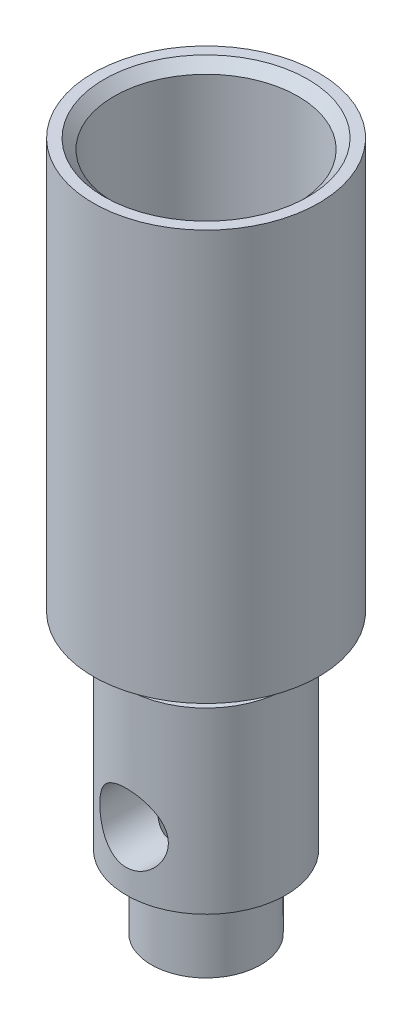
ISO-10303-21;
HEADER;
FILE_DESCRIPTION(('STEP AP214'),'2;1');
FILE_NAME('part.step','',(''),(''),'','','');
FILE_SCHEMA(('AUTOMOTIVE_DESIGN { 1 0 10303 214 1 1 1 1 }'));
ENDSEC;
DATA;
#1=APPLICATION_CONTEXT('core data for automotive mechanical design processes');
#2=APPLICATION_PROTOCOL_DEFINITION('international standard','automotive_design',2000,#1);
#3=PRODUCT_CONTEXT('',#1,'mechanical');
#4=PRODUCT('Part','Part','',(#3));
#5=PRODUCT_RELATED_PRODUCT_CATEGORY('part','',(#4));
#6=PRODUCT_DEFINITION_FORMATION('','',#4);
#7=PRODUCT_DEFINITION_CONTEXT('part definition',#1,'design');
#8=PRODUCT_DEFINITION('design','',#6,#7);
#9=PRODUCT_DEFINITION_SHAPE('','',#8);
#10=(LENGTH_UNIT() NAMED_UNIT(*) SI_UNIT(.MILLI.,.METRE.));
#11=(NAMED_UNIT(*) PLANE_ANGLE_UNIT() SI_UNIT($,.RADIAN.));
#12=(NAMED_UNIT(*) SI_UNIT($,.STERADIAN.) SOLID_ANGLE_UNIT());
#13=UNCERTAINTY_MEASURE_WITH_UNIT(LENGTH_MEASURE(1.E-05),#10,'distance_accuracy_value','');
#14=(GEOMETRIC_REPRESENTATION_CONTEXT(3) GLOBAL_UNCERTAINTY_ASSIGNED_CONTEXT((#13)) GLOBAL_UNIT_ASSIGNED_CONTEXT((#10,
#11,#12)) REPRESENTATION_CONTEXT('',''));
#15=CARTESIAN_POINT('',(0.,0.,0.));
#16=DIRECTION('',(0.,0.,1.));
#17=DIRECTION('',(1.,0.,0.));
#18=AXIS2_PLACEMENT_3D('',#15,#16,#17);
#19=CARTESIAN_POINT('',(0.,0.,0.));
#20=DIRECTION('',(0.,-1.,0.));
#21=DIRECTION('',(0.,0.,-1.));
#22=AXIS2_PLACEMENT_3D('',#19,#20,#21);
#23=CYLINDRICAL_SURFACE('',#22,5.55625);
#24=CARTESIAN_POINT('',(0.,5.08,0.));
#25=DIRECTION('',(0.,-1.,0.));
#26=DIRECTION('',(0.,0.,-1.));
#27=AXIS2_PLACEMENT_3D('',#24,#25,#26);
#28=CIRCLE('',#27,5.55625);
#29=CARTESIAN_POINT('',(0.,5.08,-5.55625));
#30=VERTEX_POINT('',#29);
#31=EDGE_CURVE('E124',#30,#30,#28,.T.);
#32=ORIENTED_EDGE('',*,*,#31,.F.);
#33=EDGE_LOOP('',(#32));
#34=FACE_BOUND('',#33,.T.);
#35=CARTESIAN_POINT('',(0.,17.526,0.));
#36=DIRECTION('',(0.,-1.,0.));
#37=DIRECTION('',(0.,0.,-1.));
#38=AXIS2_PLACEMENT_3D('',#35,#36,#37);
#39=CIRCLE('',#38,5.55625);
#40=CARTESIAN_POINT('',(0.,17.526,-5.55625));
#41=VERTEX_POINT('',#40);
#42=EDGE_CURVE('E129',#41,#41,#39,.T.);
#43=ORIENTED_EDGE('',*,*,#42,.T.);
#44=EDGE_LOOP('',(#43));
#45=FACE_BOUND('',#44,.T.);
#46=CARTESIAN_POINT('',(-2.3876,9.144,5.0170987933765));
#47=CARTESIAN_POINT('',(-2.38759394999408,9.27091680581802,5.01710512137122));
#48=CARTESIAN_POINT('',(-2.37741593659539,9.39805321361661,5.02198423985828));
#49=CARTESIAN_POINT('',(-2.33713133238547,9.64861629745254,5.04085334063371));
#50=CARTESIAN_POINT('',(-2.30697224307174,9.77203230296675,5.05486732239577));
#51=CARTESIAN_POINT('',(-2.22813032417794,10.0110864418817,5.0901068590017));
#52=CARTESIAN_POINT('',(-2.17952627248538,10.1267552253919,5.11130170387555));
#53=CARTESIAN_POINT('',(-2.0654092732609,10.3482649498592,5.1584684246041));
#54=CARTESIAN_POINT('',(-1.9998995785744,10.4541077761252,5.18443938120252));
#55=CARTESIAN_POINT('',(-1.84918996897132,10.6600379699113,5.24015587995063));
#56=CARTESIAN_POINT('',(-1.76304291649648,10.7593965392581,5.27003448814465));
#57=CARTESIAN_POINT('',(-1.57549029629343,10.9427989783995,5.32910945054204));
#58=CARTESIAN_POINT('',(-1.47407865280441,11.0268367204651,5.35830552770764));
#59=CARTESIAN_POINT('',(-1.25307017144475,11.1810141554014,5.41436083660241));
#60=CARTESIAN_POINT('',(-1.13284568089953,11.2503226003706,5.44104751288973));
#61=CARTESIAN_POINT('',(-0.881088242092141,11.3674124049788,5.4874348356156));
#62=CARTESIAN_POINT('',(-0.749560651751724,11.4152038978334,5.50713876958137));
#63=CARTESIAN_POINT('',(-0.486593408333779,11.4852268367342,5.53639486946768));
#64=CARTESIAN_POINT('',(-0.355545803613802,11.5087181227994,5.54644523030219));
#65=CARTESIAN_POINT('',(-0.0910097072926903,11.5335560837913,5.55707873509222));
#66=CARTESIAN_POINT('',(0.0424777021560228,11.5349123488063,5.55766597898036));
#67=CARTESIAN_POINT('',(0.298899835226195,11.5160770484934,5.54959232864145));
#68=CARTESIAN_POINT('',(0.421958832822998,11.4972729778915,5.54152691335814));
#69=CARTESIAN_POINT('',(0.66297641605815,11.4410442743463,5.51788409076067));
#70=CARTESIAN_POINT('',(0.78093462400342,11.4036182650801,5.50230612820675));
#71=CARTESIAN_POINT('',(1.01058344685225,11.3107800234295,5.46483218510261));
#72=CARTESIAN_POINT('',(1.12215052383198,11.2551013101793,5.44284316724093));
#73=CARTESIAN_POINT('',(1.33465144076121,11.1276098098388,5.3946740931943));
#74=CARTESIAN_POINT('',(1.43558143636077,11.0557912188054,5.36849253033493));
#75=CARTESIAN_POINT('',(1.63191608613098,10.8918641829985,5.31224569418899));
#76=CARTESIAN_POINT('',(1.72635316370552,10.7986447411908,5.2820363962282));
#77=CARTESIAN_POINT('',(1.89868884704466,10.5976675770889,5.22256862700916));
#78=CARTESIAN_POINT('',(1.97658023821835,10.4899035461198,5.19331057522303));
#79=CARTESIAN_POINT('',(2.11632512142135,10.2579102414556,5.13799091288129));
#80=CARTESIAN_POINT('',(2.17748241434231,10.1332207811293,5.11208668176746));
#81=CARTESIAN_POINT('',(2.27753022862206,9.87390616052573,5.06831206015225));
#82=CARTESIAN_POINT('',(2.31643784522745,9.73928871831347,5.05043550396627));
#83=CARTESIAN_POINT('',(2.36833576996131,9.47365512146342,5.02629786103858));
#84=CARTESIAN_POINT('',(2.38290256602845,9.34301229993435,5.01933224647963));
#85=CARTESIAN_POINT('',(2.39036026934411,9.08099121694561,5.01578699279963));
#86=CARTESIAN_POINT('',(2.38325950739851,8.94961325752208,5.01920336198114));
#87=CARTESIAN_POINT('',(2.34902455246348,8.69955717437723,5.03530557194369));
#88=CARTESIAN_POINT('',(2.32332737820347,8.58063378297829,5.04732586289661));
#89=CARTESIAN_POINT('',(2.25456591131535,8.34890087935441,5.07841111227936));
#90=CARTESIAN_POINT('',(2.21149738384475,8.23609286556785,5.09747778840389));
#91=CARTESIAN_POINT('',(2.10714498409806,8.01428819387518,5.14151576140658));
#92=CARTESIAN_POINT('',(2.04514908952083,7.90567187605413,5.16670816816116));
#93=CARTESIAN_POINT('',(1.90539516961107,7.69984138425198,5.21986279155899));
#94=CARTESIAN_POINT('',(1.82763002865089,7.60263238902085,5.24782625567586));
#95=CARTESIAN_POINT('',(1.65052261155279,7.41350173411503,5.30632785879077));
#96=CARTESIAN_POINT('',(1.54988667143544,7.32278992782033,5.33687687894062));
#97=CARTESIAN_POINT('',(1.33413545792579,7.15930001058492,5.39485516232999));
#98=CARTESIAN_POINT('',(1.21901869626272,7.08652374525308,5.42228410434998));
#99=CARTESIAN_POINT('',(0.976387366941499,6.96087162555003,5.4711932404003));
#100=CARTESIAN_POINT('',(0.848811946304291,6.90810029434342,5.49264203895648));
#101=CARTESIAN_POINT('',(0.585429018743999,6.82517820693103,5.52691372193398));
#102=CARTESIAN_POINT('',(0.449626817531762,6.79501303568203,5.5397421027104));
#103=CARTESIAN_POINT('',(0.184422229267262,6.76005768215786,5.55465910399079));
#104=CARTESIAN_POINT('',(0.0552833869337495,6.7535649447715,5.55746798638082));
#105=CARTESIAN_POINT('',(-0.202214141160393,6.76149608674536,5.55406060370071));
#106=CARTESIAN_POINT('',(-0.330572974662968,6.7759158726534,5.54784610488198));
#107=CARTESIAN_POINT('',(-0.577620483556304,6.82404143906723,5.52748069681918));
#108=CARTESIAN_POINT('',(-0.696490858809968,6.85696294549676,5.51365296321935));
#109=CARTESIAN_POINT('',(-0.926955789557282,6.94027364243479,5.4796212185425));
#110=CARTESIAN_POINT('',(-1.03854900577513,6.99066603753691,5.4594160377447));
#111=CARTESIAN_POINT('',(-1.25691717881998,7.11004353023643,5.41341784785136));
#112=CARTESIAN_POINT('',(-1.36323956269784,7.17977243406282,5.38741184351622));
#113=CARTESIAN_POINT('',(-1.56313607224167,7.33478607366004,5.33284850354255));
#114=CARTESIAN_POINT('',(-1.65670510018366,7.42007699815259,5.30429015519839));
#115=CARTESIAN_POINT('',(-1.83556612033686,7.61113619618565,5.24520000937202));
#116=CARTESIAN_POINT('',(-1.91975366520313,7.71794538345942,5.21467649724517));
#117=CARTESIAN_POINT('',(-2.0692070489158,7.94503509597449,5.15720128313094));
#118=CARTESIAN_POINT('',(-2.13446182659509,8.06532343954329,5.1302516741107));
#119=CARTESIAN_POINT('',(-2.24375276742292,8.31643097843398,5.08341040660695));
#120=CARTESIAN_POINT('',(-2.2878192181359,8.44723482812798,5.06350868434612));
#121=CARTESIAN_POINT('',(-2.33655637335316,8.64811814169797,5.04110266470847));
#122=CARTESIAN_POINT('',(-2.34990392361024,8.71579306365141,5.03487744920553));
#123=CARTESIAN_POINT('',(-2.3707053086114,8.85221836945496,5.02511781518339));
#124=CARTESIAN_POINT('',(-2.37816365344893,8.92096788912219,5.02158133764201));
#125=CARTESIAN_POINT('',(-2.38428168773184,9.0155639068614,5.01867683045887));
#126=CARTESIAN_POINT('',(-2.38552536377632,9.04123087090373,5.01808580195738));
#127=CARTESIAN_POINT('',(-2.38718513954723,9.09259555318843,5.01729613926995));
#128=CARTESIAN_POINT('',(-2.38760122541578,9.11829327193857,5.01709751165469));
#129=CARTESIAN_POINT('',(-2.3876,9.144,5.0170987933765));
#130=B_SPLINE_CURVE_WITH_KNOTS('',3,(#46,#47,#48,#49,#50,#51,#52,#53,#54,#55,#56,#57,#58,#59,
#60,#61,#62,#63,#64,#65,#66,#67,#68,#69,#70,#71,#72,#73,#74,#75,#76,#77,#78,#79,#80,#81,#82,#83,
#84,#85,#86,#87,#88,#89,#90,#91,#92,#93,#94,#95,#96,#97,#98,#99,#100,#101,#102,#103,#104,#105,
#106,#107,#108,#109,#110,#111,#112,#113,#114,#115,#116,#117,#118,#119,#120,#121,#122,#123,#124,
#125,#126,#127,#128,#129),.UNSPECIFIED.,.T.,.F.,(4,2,2,2,2,2,2,2,2,2,2,2,2,2,2,2,2,2,2,2,2,2,2,
2,2,2,2,2,2,2,2,2,2,2,2,2,2,2,2,2,2,4),(0.,0.380647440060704,0.762298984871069,1.1423385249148,
1.52230499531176,1.92511957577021,2.32809491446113,2.74986940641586,3.17144505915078,
3.56986297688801,3.9681082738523,4.34060522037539,4.71312970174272,5.09135497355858,
5.46971647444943,5.8761876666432,6.28283573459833,6.70445817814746,7.12575623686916,
7.51852811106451,7.91114899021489,8.27628855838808,8.64151719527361,9.02266234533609,
9.40397986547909,9.81871317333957,10.2334891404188,10.6504033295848,11.0670514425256,
11.4530669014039,11.83900681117,12.2097024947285,12.5804662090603,12.9681569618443,
13.3560022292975,13.7721883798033,14.1886171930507,14.6044489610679,14.8119752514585,
15.0193424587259,15.096440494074,15.1735398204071),.UNSPECIFIED.);
#131=CARTESIAN_POINT('',(-2.3876,9.144,5.0170987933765));
#132=VERTEX_POINT('',#131);
#133=EDGE_CURVE('E96',#132,#132,#130,.T.);
#134=ORIENTED_EDGE('',*,*,#133,.T.);
#135=EDGE_LOOP('',(#134));
#136=FACE_BOUND('',#135,.T.);
#137=ADVANCED_FACE('F28',(#34,#45,#136),#23,.T.);
#138=CARTESIAN_POINT('',(0.,0.,0.));
#139=DIRECTION('',(0.,-1.,0.));
#140=DIRECTION('',(0.,0.,-1.));
#141=AXIS2_PLACEMENT_3D('',#138,#139,#140);
#142=CYLINDRICAL_SURFACE('',#141,2.3876);
#143=CARTESIAN_POINT('',(0.,25.781,0.));
#144=DIRECTION('',(0.,-1.,0.));
#145=DIRECTION('',(0.,0.,-1.));
#146=AXIS2_PLACEMENT_3D('',#143,#144,#145);
#147=CIRCLE('',#146,2.3876);
#148=CARTESIAN_POINT('',(0.,25.781,-2.3876));
#149=VERTEX_POINT('',#148);
#150=EDGE_CURVE('E150',#149,#149,#147,.T.);
#151=ORIENTED_EDGE('',*,*,#150,.F.);
#152=EDGE_LOOP('',(#151));
#153=FACE_BOUND('',#152,.T.);
#154=CARTESIAN_POINT('',(0.,0.,0.));
#155=DIRECTION('',(0.,-1.,0.));
#156=DIRECTION('',(0.,0.,-1.));
#157=AXIS2_PLACEMENT_3D('',#154,#155,#156);
#158=CIRCLE('',#157,2.38760000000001);
#159=CARTESIAN_POINT('',(0.,0.,-2.38760000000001));
#160=VERTEX_POINT('',#159);
#161=EDGE_CURVE('E152',#160,#160,#158,.T.);
#162=ORIENTED_EDGE('',*,*,#161,.T.);
#163=EDGE_LOOP('',(#162));
#164=FACE_BOUND('',#163,.T.);
#165=CARTESIAN_POINT('',(0.,9.144,0.));
#166=DIRECTION('',(0.,-0.707106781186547,0.707106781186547));
#167=DIRECTION('',(0.,-0.707106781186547,-0.707106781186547));
#168=AXIS2_PLACEMENT_3D('',#165,#166,#167);
#169=ELLIPSE('',#168,3.376576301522,2.3876);
#170=CARTESIAN_POINT('',(2.3876,9.144,0.));
#171=VERTEX_POINT('',#170);
#172=CARTESIAN_POINT('',(-2.3876,9.144,0.));
#173=VERTEX_POINT('',#172);
#174=EDGE_CURVE('E36',#171,#173,#169,.T.);
#175=ORIENTED_EDGE('',*,*,#174,.T.);
#176=CARTESIAN_POINT('',(0.,9.144,0.));
#177=DIRECTION('',(0.,-0.707106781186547,-0.707106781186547));
#178=DIRECTION('',(0.,-0.707106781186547,0.707106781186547));
#179=AXIS2_PLACEMENT_3D('',#176,#177,#178);
#180=ELLIPSE('',#179,3.376576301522,2.3876);
#181=EDGE_CURVE('E11',#173,#171,#180,.F.);
#182=ORIENTED_EDGE('',*,*,#181,.T.);
#183=EDGE_LOOP('',(#175,#182));
#184=FACE_BOUND('',#183,.T.);
#185=ADVANCED_FACE('F45',(#153,#164,#184),#142,.F.);
#186=CARTESIAN_POINT('',(0.,0.,0.));
#187=DIRECTION('',(0.,-1.,0.));
#188=DIRECTION('',(0.,0.,-1.));
#189=AXIS2_PLACEMENT_3D('',#186,#187,#188);
#190=CYLINDRICAL_SURFACE('',#189,3.81);
#191=CARTESIAN_POINT('',(0.,5.08,0.));
#192=DIRECTION('',(0.,-1.,0.));
#193=DIRECTION('',(0.,0.,-1.));
#194=AXIS2_PLACEMENT_3D('',#191,#192,#193);
#195=CIRCLE('',#194,3.81);
#196=CARTESIAN_POINT('',(0.,5.08,-3.81));
#197=VERTEX_POINT('',#196);
#198=EDGE_CURVE('E120',#197,#197,#195,.T.);
#199=ORIENTED_EDGE('',*,*,#198,.T.);
#200=EDGE_LOOP('',(#199));
#201=FACE_BOUND('',#200,.T.);
#202=CARTESIAN_POINT('',(0.,0.,0.));
#203=DIRECTION('',(0.,-1.,0.));
#204=DIRECTION('',(0.,0.,-1.));
#205=AXIS2_PLACEMENT_3D('',#202,#203,#204);
#206=CIRCLE('',#205,3.81);
#207=CARTESIAN_POINT('',(0.,0.,-3.81));
#208=VERTEX_POINT('',#207);
#209=EDGE_CURVE('E102',#208,#208,#206,.T.);
#210=ORIENTED_EDGE('',*,*,#209,.F.);
#211=EDGE_LOOP('',(#210));
#212=FACE_BOUND('',#211,.T.);
#213=ADVANCED_FACE('F30',(#201,#212),#190,.T.);
#214=CARTESIAN_POINT('',(3.81,5.08,0.));
#215=DIRECTION('',(0.,-1.,0.));
#216=DIRECTION('',(0.,0.,-1.));
#217=AXIS2_PLACEMENT_3D('',#214,#215,#216);
#218=PLANE('',#217);
#219=ORIENTED_EDGE('',*,*,#31,.T.);
#220=EDGE_LOOP('',(#219));
#221=FACE_BOUND('',#220,.T.);
#222=ORIENTED_EDGE('',*,*,#198,.F.);
#223=EDGE_LOOP('',(#222));
#224=FACE_BOUND('',#223,.T.);
#225=ADVANCED_FACE('F53',(#221,#224),#218,.T.);
#226=CARTESIAN_POINT('',(5.55625,17.526,0.));
#227=DIRECTION('',(0.,1.,0.));
#228=DIRECTION('',(0.,0.,1.));
#229=AXIS2_PLACEMENT_3D('',#226,#227,#228);
#230=PLANE('',#229);
#231=CARTESIAN_POINT('',(0.,17.526,0.));
#232=DIRECTION('',(0.,-1.,0.));
#233=DIRECTION('',(0.,0.,-1.));
#234=AXIS2_PLACEMENT_3D('',#231,#232,#233);
#235=CIRCLE('',#234,4.6228);
#236=CARTESIAN_POINT('',(0.,17.526,-4.6228));
#237=VERTEX_POINT('',#236);
#238=EDGE_CURVE('E132',#237,#237,#235,.T.);
#239=ORIENTED_EDGE('',*,*,#238,.T.);
#240=EDGE_LOOP('',(#239));
#241=FACE_BOUND('',#240,.T.);
#242=ORIENTED_EDGE('',*,*,#42,.F.);
#243=EDGE_LOOP('',(#242));
#244=FACE_BOUND('',#243,.T.);
#245=ADVANCED_FACE('F90',(#241,#244),#230,.T.);
#246=CARTESIAN_POINT('',(0.,0.,0.));
#247=DIRECTION('',(0.,-1.,0.));
#248=DIRECTION('',(0.,0.,-1.));
#249=AXIS2_PLACEMENT_3D('',#246,#247,#248);
#250=CYLINDRICAL_SURFACE('',#249,4.6228);
#251=CARTESIAN_POINT('',(0.,18.6436,0.));
#252=DIRECTION('',(0.,-1.,0.));
#253=DIRECTION('',(0.,0.,-1.));
#254=AXIS2_PLACEMENT_3D('',#251,#252,#253);
#255=CIRCLE('',#254,4.6228);
#256=CARTESIAN_POINT('',(0.,18.6436,-4.6228));
#257=VERTEX_POINT('',#256);
#258=EDGE_CURVE('E119',#257,#257,#255,.T.);
#259=ORIENTED_EDGE('',*,*,#258,.T.);
#260=EDGE_LOOP('',(#259));
#261=FACE_BOUND('',#260,.T.);
#262=ORIENTED_EDGE('',*,*,#238,.F.);
#263=EDGE_LOOP('',(#262));
#264=FACE_BOUND('',#263,.T.);
#265=ADVANCED_FACE('F86',(#261,#264),#250,.T.);
#266=CARTESIAN_POINT('',(4.6228,19.431,0.));
#267=DIRECTION('',(0.,-1.,0.));
#268=DIRECTION('',(0.,0.,-1.));
#269=AXIS2_PLACEMENT_3D('',#266,#267,#268);
#270=PLANE('',#269);
#271=CARTESIAN_POINT('',(0.,19.431,0.));
#272=DIRECTION('',(0.,-1.,0.));
#273=DIRECTION('',(0.,0.,-1.));
#274=AXIS2_PLACEMENT_3D('',#271,#272,#273);
#275=CIRCLE('',#274,5.4102);
#276=CARTESIAN_POINT('',(0.,19.431,-5.4102));
#277=VERTEX_POINT('',#276);
#278=EDGE_CURVE('E44',#277,#277,#275,.F.);
#279=ORIENTED_EDGE('',*,*,#278,.T.);
#280=EDGE_LOOP('',(#279));
#281=FACE_BOUND('',#280,.T.);
#282=CARTESIAN_POINT('',(0.,19.431,0.));
#283=DIRECTION('',(0.,-1.,0.));
#284=DIRECTION('',(0.,0.,-1.));
#285=AXIS2_PLACEMENT_3D('',#282,#283,#284);
#286=CIRCLE('',#285,7.8613);
#287=CARTESIAN_POINT('',(0.,19.431,-7.8613));
#288=VERTEX_POINT('',#287);
#289=EDGE_CURVE('E135',#288,#288,#286,.T.);
#290=ORIENTED_EDGE('',*,*,#289,.T.);
#291=EDGE_LOOP('',(#290));
#292=FACE_BOUND('',#291,.T.);
#293=ADVANCED_FACE('F82',(#281,#292),#270,.T.);
#294=CARTESIAN_POINT('',(0.,0.,0.));
#295=DIRECTION('',(0.,-1.,0.));
#296=DIRECTION('',(0.,0.,-1.));
#297=AXIS2_PLACEMENT_3D('',#294,#295,#296);
#298=CYLINDRICAL_SURFACE('',#297,7.8613);
#299=CARTESIAN_POINT('',(0.,48.006,0.));
#300=DIRECTION('',(0.,-1.,0.));
#301=DIRECTION('',(0.,0.,-1.));
#302=AXIS2_PLACEMENT_3D('',#299,#300,#301);
#303=CIRCLE('',#302,7.8613);
#304=CARTESIAN_POINT('',(0.,48.006,-7.8613));
#305=VERTEX_POINT('',#304);
#306=EDGE_CURVE('E138',#305,#305,#303,.T.);
#307=ORIENTED_EDGE('',*,*,#306,.T.);
#308=EDGE_LOOP('',(#307));
#309=FACE_BOUND('',#308,.T.);
#310=ORIENTED_EDGE('',*,*,#289,.F.);
#311=EDGE_LOOP('',(#310));
#312=FACE_BOUND('',#311,.T.);
#313=ADVANCED_FACE('F78',(#309,#312),#298,.T.);
#314=CARTESIAN_POINT('',(7.8613,48.006,0.));
#315=DIRECTION('',(0.,1.,0.));
#316=DIRECTION('',(0.,0.,1.));
#317=AXIS2_PLACEMENT_3D('',#314,#315,#316);
#318=PLANE('',#317);
#319=CARTESIAN_POINT('',(0.,48.006,0.));
#320=DIRECTION('',(0.,-1.,0.));
#321=DIRECTION('',(0.,0.,-1.));
#322=AXIS2_PLACEMENT_3D('',#319,#320,#321);
#323=CIRCLE('',#322,7.0993);
#324=CARTESIAN_POINT('',(0.,48.006,-7.0993));
#325=VERTEX_POINT('',#324);
#326=EDGE_CURVE('E141',#325,#325,#323,.T.);
#327=ORIENTED_EDGE('',*,*,#326,.T.);
#328=EDGE_LOOP('',(#327));
#329=FACE_BOUND('',#328,.T.);
#330=ORIENTED_EDGE('',*,*,#306,.F.);
#331=EDGE_LOOP('',(#330));
#332=FACE_BOUND('',#331,.T.);
#333=ADVANCED_FACE('F74',(#329,#332),#318,.T.);
#334=CARTESIAN_POINT('',(0.,48.006,0.));
#335=DIRECTION('',(0.,1.,0.));
#336=DIRECTION('',(0.,0.,1.));
#337=AXIS2_PLACEMENT_3D('',#334,#335,#336);
#338=CONICAL_SURFACE('',#337,7.0993,0.785398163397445);
#339=CARTESIAN_POINT('',(0.,47.3202,0.));
#340=DIRECTION('',(0.,-1.,0.));
#341=DIRECTION('',(0.,0.,-1.));
#342=AXIS2_PLACEMENT_3D('',#339,#340,#341);
#343=CIRCLE('',#342,6.4135);
#344=CARTESIAN_POINT('',(0.,47.3202,-6.4135));
#345=VERTEX_POINT('',#344);
#346=EDGE_CURVE('E144',#345,#345,#343,.T.);
#347=ORIENTED_EDGE('',*,*,#346,.T.);
#348=EDGE_LOOP('',(#347));
#349=FACE_BOUND('',#348,.T.);
#350=ORIENTED_EDGE('',*,*,#326,.F.);
#351=EDGE_LOOP('',(#350));
#352=FACE_BOUND('',#351,.T.);
#353=ADVANCED_FACE('F70',(#349,#352),#338,.F.);
#354=CARTESIAN_POINT('',(0.,0.,0.));
#355=DIRECTION('',(0.,-1.,0.));
#356=DIRECTION('',(0.,0.,-1.));
#357=AXIS2_PLACEMENT_3D('',#354,#355,#356);
#358=CYLINDRICAL_SURFACE('',#357,6.4135);
#359=CARTESIAN_POINT('',(0.,25.781,0.));
#360=DIRECTION('',(0.,-1.,0.));
#361=DIRECTION('',(0.,0.,-1.));
#362=AXIS2_PLACEMENT_3D('',#359,#360,#361);
#363=CIRCLE('',#362,6.4135);
#364=CARTESIAN_POINT('',(0.,25.781,-6.4135));
#365=VERTEX_POINT('',#364);
#366=EDGE_CURVE('E147',#365,#365,#363,.T.);
#367=ORIENTED_EDGE('',*,*,#366,.T.);
#368=EDGE_LOOP('',(#367));
#369=FACE_BOUND('',#368,.T.);
#370=ORIENTED_EDGE('',*,*,#346,.F.);
#371=EDGE_LOOP('',(#370));
#372=FACE_BOUND('',#371,.T.);
#373=ADVANCED_FACE('F66',(#369,#372),#358,.F.);
#374=CARTESIAN_POINT('',(2.3876,25.781,0.));
#375=DIRECTION('',(0.,1.,0.));
#376=DIRECTION('',(0.,0.,1.));
#377=AXIS2_PLACEMENT_3D('',#374,#375,#376);
#378=PLANE('',#377);
#379=ORIENTED_EDGE('',*,*,#150,.T.);
#380=EDGE_LOOP('',(#379));
#381=FACE_BOUND('',#380,.T.);
#382=ORIENTED_EDGE('',*,*,#366,.F.);
#383=EDGE_LOOP('',(#382));
#384=FACE_BOUND('',#383,.T.);
#385=ADVANCED_FACE('F63',(#381,#384),#378,.T.);
#386=CARTESIAN_POINT('',(2.38760000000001,0.,0.));
#387=DIRECTION('',(0.,-1.,0.));
#388=DIRECTION('',(0.,0.,-1.));
#389=AXIS2_PLACEMENT_3D('',#386,#387,#388);
#390=PLANE('',#389);
#391=ORIENTED_EDGE('',*,*,#209,.T.);
#392=EDGE_LOOP('',(#391));
#393=FACE_BOUND('',#392,.T.);
#394=ORIENTED_EDGE('',*,*,#161,.F.);
#395=EDGE_LOOP('',(#394));
#396=FACE_BOUND('',#395,.T.);
#397=ADVANCED_FACE('F61',(#393,#396),#390,.T.);
#398=CARTESIAN_POINT('',(0.,18.6436,0.));
#399=DIRECTION('',(0.,-1.,0.));
#400=DIRECTION('',(0.,0.,-1.));
#401=AXIS2_PLACEMENT_3D('',#398,#399,#400);
#402=TOROIDAL_SURFACE('',#401,5.4102,0.7874);
#403=ORIENTED_EDGE('',*,*,#278,.F.);
#404=EDGE_LOOP('',(#403));
#405=FACE_BOUND('',#404,.T.);
#406=ORIENTED_EDGE('',*,*,#258,.F.);
#407=EDGE_LOOP('',(#406));
#408=FACE_BOUND('',#407,.T.);
#409=ADVANCED_FACE('F106',(#405,#408),#402,.F.);
#410=CARTESIAN_POINT('',(0.,9.144,7.8613));
#411=DIRECTION('',(0.,0.,-1.));
#412=DIRECTION('',(-1.,0.,0.));
#413=AXIS2_PLACEMENT_3D('',#410,#411,#412);
#414=CYLINDRICAL_SURFACE('',#413,2.3876);
#415=ORIENTED_EDGE('',*,*,#133,.F.);
#416=EDGE_LOOP('',(#415));
#417=FACE_BOUND('',#416,.T.);
#418=ORIENTED_EDGE('',*,*,#174,.F.);
#419=ORIENTED_EDGE('',*,*,#181,.F.);
#420=EDGE_LOOP('',(#418,#419));
#421=FACE_BOUND('',#420,.T.);
#422=ADVANCED_FACE('F42',(#417,#421),#414,.F.);
#423=CLOSED_SHELL('',(#137,#185,#213,#225,#245,#265,#293,#313,#333,#353,#373,#385,#397,#409,#422));
#424=MANIFOLD_SOLID_BREP('B2',#423);
#425=ADVANCED_BREP_SHAPE_REPRESENTATION('',(#18,#424),#14);
#426=SHAPE_DEFINITION_REPRESENTATION(#9,#425);
ENDSEC;
END-ISO-10303-21;
